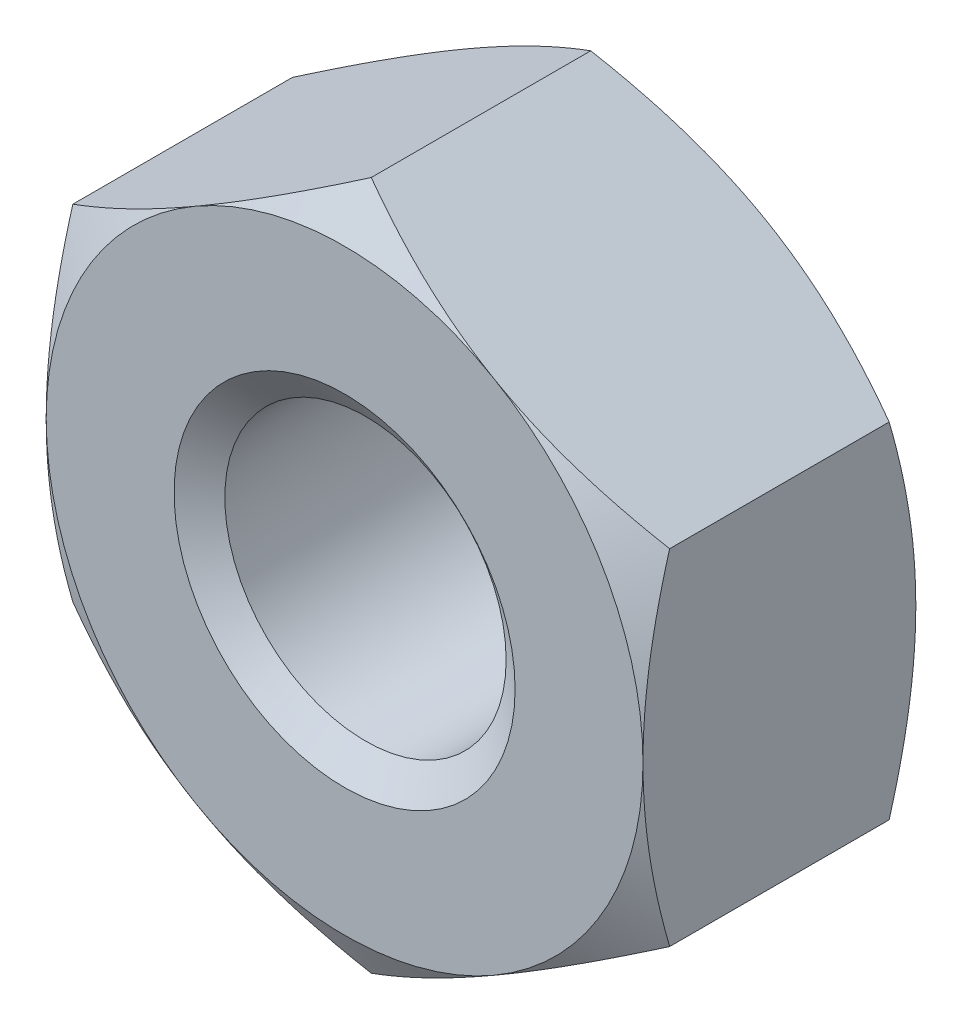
from build123d import *

# Parameters (mm, degrees)
BASENUTSKE_R  = 1.65
BASENUT_DEPTH = 3.2


with BuildPart() as part:
    # BaseNutSke → BaseNut (new body)
    with BuildSketch(Plane.XY):
        Polygon((3.5, 2.020725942), (3.5, -2.020725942), (0, -4.041451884), (-3.5, -2.020725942), (-3.5, 2.020725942), (0, 4.041451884), align=None)
        Circle(BASENUTSKE_R, mode=Mode.SUBTRACT)
    extrude(amount=-BASENUT_DEPTH)

    # Sketch3 → Double-Chamfer (revolve, cut)
    with BuildSketch(Plane(origin=(0, 0, 0), x_dir=(0, 0, -1), z_dir=(1, 0, 0))):
        Polygon((3.2, 3.5), (2.887392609, 4.041451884), (2.887392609, 14.041451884), (13.2, 14.041451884), (13.2, 3.5), align=None)
        Polygon((0.312607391, 14.041451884), (-10, 14.041451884), (-10, 3.5), (0, 3.5), (0.312607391, 4.041451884), align=None)
    revolve(axis=Axis((0, 0, 0), (0, 0, -1)), mode=Mode.SUBTRACT)

    # Sketch5 (on Right Plane) → EndChamfer (revolve, cut)
    with BuildSketch(Plane(origin=(0, 0, 0), x_dir=(0, 0, -1), z_dir=(1, 0, 0)), mode=Mode.PRIVATE) as endchamfer_sk:
        Polygon((3.1746, 2), (2.905020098, 1.615), (3.2254, 1.615), (3.2254, 2), align=None)
        Polygon((-0.0508, 2), (0, 2), (0.269579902, 1.615), (-0.0508, 1.615), align=None)
    revolve(endchamfer_sk.sketch.rotate(Axis((0, 0, -25.037505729), (0, 0, -1)), 90), axis=Axis((0, 0, -25.037505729), (0, 0, -1)), mode=Mode.SUBTRACT)


solid = part.part
